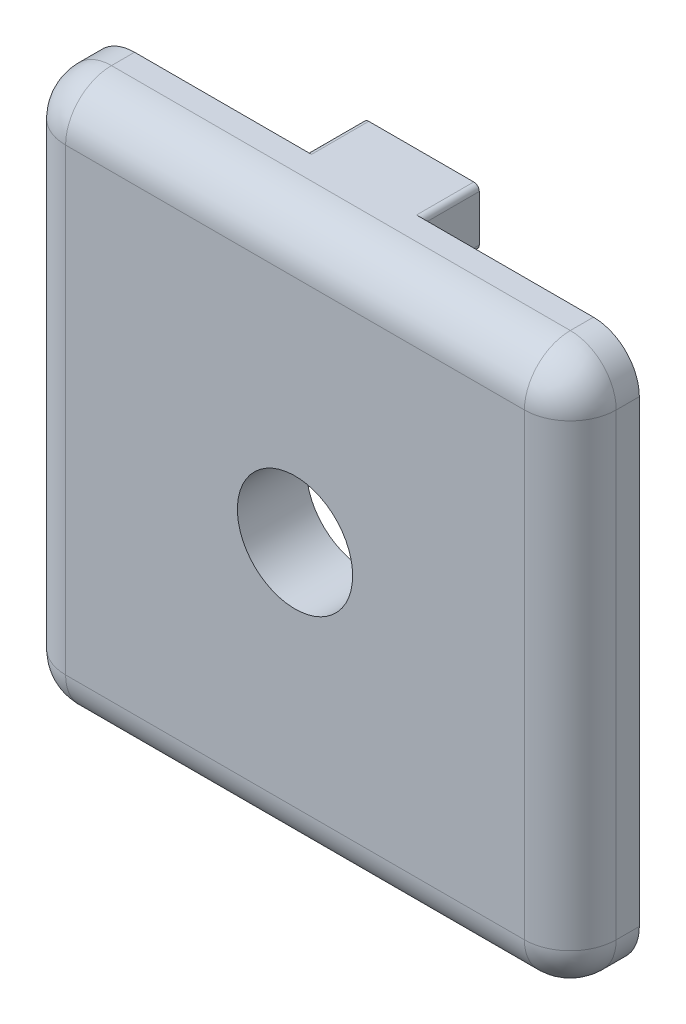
ISO-10303-21;
HEADER;
FILE_DESCRIPTION(('STEP AP214'),'2;1');
FILE_NAME('part.step','',(''),(''),'','','');
FILE_SCHEMA(('AUTOMOTIVE_DESIGN { 1 0 10303 214 1 1 1 1 }'));
ENDSEC;
DATA;
#1=APPLICATION_CONTEXT('core data for automotive mechanical design processes');
#2=APPLICATION_PROTOCOL_DEFINITION('international standard','automotive_design',2000,#1);
#3=PRODUCT_CONTEXT('',#1,'mechanical');
#4=PRODUCT('Part','Part','',(#3));
#5=PRODUCT_RELATED_PRODUCT_CATEGORY('part','',(#4));
#6=PRODUCT_DEFINITION_FORMATION('','',#4);
#7=PRODUCT_DEFINITION_CONTEXT('part definition',#1,'design');
#8=PRODUCT_DEFINITION('design','',#6,#7);
#9=PRODUCT_DEFINITION_SHAPE('','',#8);
#10=(LENGTH_UNIT() NAMED_UNIT(*) SI_UNIT(.MILLI.,.METRE.));
#11=(NAMED_UNIT(*) PLANE_ANGLE_UNIT() SI_UNIT($,.RADIAN.));
#12=(NAMED_UNIT(*) SI_UNIT($,.STERADIAN.) SOLID_ANGLE_UNIT());
#13=UNCERTAINTY_MEASURE_WITH_UNIT(LENGTH_MEASURE(1.E-05),#10,'distance_accuracy_value','');
#14=(GEOMETRIC_REPRESENTATION_CONTEXT(3) GLOBAL_UNCERTAINTY_ASSIGNED_CONTEXT((#13)) GLOBAL_UNIT_ASSIGNED_CONTEXT((#10,
#11,#12)) REPRESENTATION_CONTEXT('',''));
#15=CARTESIAN_POINT('',(0.,0.,0.));
#16=DIRECTION('',(0.,0.,1.));
#17=DIRECTION('',(1.,0.,0.));
#18=AXIS2_PLACEMENT_3D('',#15,#16,#17);
#19=CARTESIAN_POINT('',(-19.05,-19.05,0.));
#20=DIRECTION('',(0.,0.,1.));
#21=DIRECTION('',(1.,0.,0.));
#22=AXIS2_PLACEMENT_3D('',#19,#20,#21);
#23=PLANE('',#22);
#24=CARTESIAN_POINT('',(0.,0.,0.));
#25=DIRECTION('',(0.,0.,1.));
#26=DIRECTION('',(1.,0.,0.));
#27=AXIS2_PLACEMENT_3D('',#24,#25,#26);
#28=CIRCLE('',#27,3.9878);
#29=CARTESIAN_POINT('',(3.9878,0.,0.));
#30=VERTEX_POINT('',#29);
#31=EDGE_CURVE('E167',#30,#30,#28,.F.);
#32=ORIENTED_EDGE('',*,*,#31,.F.);
#33=EDGE_LOOP('',(#32));
#34=FACE_BOUND('',#33,.T.);
#35=DIRECTION('',(0.,-1.,0.));
#36=VECTOR('',#35,1.);
#37=CARTESIAN_POINT('',(4.0132,19.05,0.));
#38=LINE('',#37,#36);
#39=CARTESIAN_POINT('',(4.0132,18.669,0.));
#40=VERTEX_POINT('',#39);
#41=CARTESIAN_POINT('',(4.0132,15.4686,0.));
#42=VERTEX_POINT('',#41);
#43=EDGE_CURVE('E335',#40,#42,#38,.T.);
#44=ORIENTED_EDGE('',*,*,#43,.F.);
#45=CARTESIAN_POINT('',(3.6322,18.669,0.));
#46=DIRECTION('',(0.,0.,1.));
#47=DIRECTION('',(1.,0.,0.));
#48=AXIS2_PLACEMENT_3D('',#45,#46,#47);
#49=CIRCLE('',#48,0.381);
#50=CARTESIAN_POINT('',(3.6322,19.05,0.));
#51=VERTEX_POINT('',#50);
#52=EDGE_CURVE('E11',#40,#51,#49,.T.);
#53=ORIENTED_EDGE('',*,*,#52,.T.);
#54=DIRECTION('',(-1.,0.,0.));
#55=VECTOR('',#54,1.);
#56=CARTESIAN_POINT('',(-19.05,19.05,0.));
#57=LINE('',#56,#55);
#58=CARTESIAN_POINT('',(15.875,19.05,0.));
#59=VERTEX_POINT('',#58);
#60=EDGE_CURVE('E55',#59,#51,#57,.T.);
#61=ORIENTED_EDGE('',*,*,#60,.F.);
#62=CARTESIAN_POINT('',(15.875,15.875,0.));
#63=DIRECTION('',(0.,0.,1.));
#64=DIRECTION('',(1.,0.,0.));
#65=AXIS2_PLACEMENT_3D('',#62,#63,#64);
#66=CIRCLE('',#65,3.175);
#67=CARTESIAN_POINT('',(19.05,15.875,0.));
#68=VERTEX_POINT('',#67);
#69=EDGE_CURVE('E221',#59,#68,#66,.F.);
#70=ORIENTED_EDGE('',*,*,#69,.T.);
#71=DIRECTION('',(0.,1.,0.));
#72=VECTOR('',#71,1.);
#73=CARTESIAN_POINT('',(19.05,19.05,0.));
#74=LINE('',#73,#72);
#75=CARTESIAN_POINT('',(19.05,-15.875,0.));
#76=VERTEX_POINT('',#75);
#77=EDGE_CURVE('E257',#76,#68,#74,.T.);
#78=ORIENTED_EDGE('',*,*,#77,.F.);
#79=CARTESIAN_POINT('',(15.875,-15.875,0.));
#80=DIRECTION('',(0.,0.,1.));
#81=DIRECTION('',(1.,0.,0.));
#82=AXIS2_PLACEMENT_3D('',#79,#80,#81);
#83=CIRCLE('',#82,3.175);
#84=CARTESIAN_POINT('',(15.875,-19.05,0.));
#85=VERTEX_POINT('',#84);
#86=EDGE_CURVE('E223',#76,#85,#83,.F.);
#87=ORIENTED_EDGE('',*,*,#86,.T.);
#88=DIRECTION('',(1.,0.,0.));
#89=VECTOR('',#88,1.);
#90=CARTESIAN_POINT('',(-19.05,-19.05,0.));
#91=LINE('',#90,#89);
#92=CARTESIAN_POINT('',(-15.875,-19.05,0.));
#93=VERTEX_POINT('',#92);
#94=EDGE_CURVE('E297',#93,#85,#91,.T.);
#95=ORIENTED_EDGE('',*,*,#94,.F.);
#96=CARTESIAN_POINT('',(-15.875,-15.875,0.));
#97=DIRECTION('',(0.,0.,1.));
#98=DIRECTION('',(1.,0.,0.));
#99=AXIS2_PLACEMENT_3D('',#96,#97,#98);
#100=CIRCLE('',#99,3.175);
#101=CARTESIAN_POINT('',(-19.05,-15.875,0.));
#102=VERTEX_POINT('',#101);
#103=EDGE_CURVE('E225',#93,#102,#100,.F.);
#104=ORIENTED_EDGE('',*,*,#103,.T.);
#105=DIRECTION('',(0.,-1.,0.));
#106=VECTOR('',#105,1.);
#107=CARTESIAN_POINT('',(-19.05,19.05,0.));
#108=LINE('',#107,#106);
#109=CARTESIAN_POINT('',(-19.05,15.875,0.));
#110=VERTEX_POINT('',#109);
#111=EDGE_CURVE('E251',#110,#102,#108,.T.);
#112=ORIENTED_EDGE('',*,*,#111,.F.);
#113=CARTESIAN_POINT('',(-15.875,15.875,0.));
#114=DIRECTION('',(0.,0.,1.));
#115=DIRECTION('',(1.,0.,0.));
#116=AXIS2_PLACEMENT_3D('',#113,#114,#115);
#117=CIRCLE('',#116,3.175);
#118=CARTESIAN_POINT('',(-15.875,19.05,0.));
#119=VERTEX_POINT('',#118);
#120=EDGE_CURVE('E219',#110,#119,#117,.F.);
#121=ORIENTED_EDGE('',*,*,#120,.T.);
#122=CARTESIAN_POINT('',(-3.6322,19.05,0.));
#123=VERTEX_POINT('',#122);
#124=EDGE_CURVE('E47',#123,#119,#57,.T.);
#125=ORIENTED_EDGE('',*,*,#124,.F.);
#126=CARTESIAN_POINT('',(-3.6322,18.669,0.));
#127=DIRECTION('',(0.,0.,1.));
#128=DIRECTION('',(1.,0.,0.));
#129=AXIS2_PLACEMENT_3D('',#126,#127,#128);
#130=CIRCLE('',#129,0.381);
#131=CARTESIAN_POINT('',(-4.0132,18.669,0.));
#132=VERTEX_POINT('',#131);
#133=EDGE_CURVE('E40',#123,#132,#130,.T.);
#134=ORIENTED_EDGE('',*,*,#133,.T.);
#135=DIRECTION('',(0.,1.,0.));
#136=VECTOR('',#135,1.);
#137=CARTESIAN_POINT('',(-4.0132,19.05,0.));
#138=LINE('',#137,#136);
#139=CARTESIAN_POINT('',(-4.0132,15.4686,0.));
#140=VERTEX_POINT('',#139);
#141=EDGE_CURVE('E312',#140,#132,#138,.T.);
#142=ORIENTED_EDGE('',*,*,#141,.F.);
#143=CARTESIAN_POINT('',(-3.6322,15.4686,0.));
#144=DIRECTION('',(0.,0.,1.));
#145=DIRECTION('',(1.,0.,0.));
#146=AXIS2_PLACEMENT_3D('',#143,#144,#145);
#147=CIRCLE('',#146,0.381);
#148=CARTESIAN_POINT('',(-3.6322,15.0876,0.));
#149=VERTEX_POINT('',#148);
#150=EDGE_CURVE('E346',#140,#149,#147,.T.);
#151=ORIENTED_EDGE('',*,*,#150,.T.);
#152=DIRECTION('',(-1.,0.,0.));
#153=VECTOR('',#152,1.);
#154=CARTESIAN_POINT('',(4.0132,15.0876,0.));
#155=LINE('',#154,#153);
#156=CARTESIAN_POINT('',(3.6322,15.0876,0.));
#157=VERTEX_POINT('',#156);
#158=EDGE_CURVE('E309',#157,#149,#155,.T.);
#159=ORIENTED_EDGE('',*,*,#158,.F.);
#160=CARTESIAN_POINT('',(3.6322,15.4686,0.));
#161=DIRECTION('',(0.,0.,1.));
#162=DIRECTION('',(1.,0.,0.));
#163=AXIS2_PLACEMENT_3D('',#160,#161,#162);
#164=CIRCLE('',#163,0.381);
#165=EDGE_CURVE('E348',#157,#42,#164,.T.);
#166=ORIENTED_EDGE('',*,*,#165,.T.);
#167=EDGE_LOOP('',(#44,#53,#61,#70,#78,#87,#95,#104,#112,#121,#125,#134,#142,#151,#159,#166));
#168=FACE_BOUND('',#167,.T.);
#169=ADVANCED_FACE('F32',(#34,#168),#23,.F.);
#170=CARTESIAN_POINT('',(-19.05,19.05,4.7752));
#171=DIRECTION('',(1.,0.,0.));
#172=DIRECTION('',(0.,0.,-1.));
#173=AXIS2_PLACEMENT_3D('',#170,#171,#172);
#174=PLANE('',#173);
#175=ORIENTED_EDGE('',*,*,#111,.T.);
#176=DIRECTION('',(0.,0.,-1.));
#177=VECTOR('',#176,1.);
#178=CARTESIAN_POINT('',(-19.05,-15.875,4.7752));
#179=LINE('',#178,#177);
#180=CARTESIAN_POINT('',(-19.05,-15.875,1.6002));
#181=VERTEX_POINT('',#180);
#182=EDGE_CURVE('E217',#102,#181,#179,.F.);
#183=ORIENTED_EDGE('',*,*,#182,.T.);
#184=DIRECTION('',(0.,-1.,0.));
#185=VECTOR('',#184,1.);
#186=CARTESIAN_POINT('',(-19.05,19.05,1.6002));
#187=LINE('',#186,#185);
#188=CARTESIAN_POINT('',(-19.05,15.875,1.6002));
#189=VERTEX_POINT('',#188);
#190=EDGE_CURVE('E215',#181,#189,#187,.F.);
#191=ORIENTED_EDGE('',*,*,#190,.T.);
#192=DIRECTION('',(0.,0.,-1.));
#193=VECTOR('',#192,1.);
#194=CARTESIAN_POINT('',(-19.05,15.875,4.7752));
#195=LINE('',#194,#193);
#196=EDGE_CURVE('E213',#189,#110,#195,.T.);
#197=ORIENTED_EDGE('',*,*,#196,.T.);
#198=EDGE_LOOP('',(#175,#183,#191,#197));
#199=FACE_BOUND('',#198,.T.);
#200=ADVANCED_FACE('F292',(#199),#174,.F.);
#201=CARTESIAN_POINT('',(-19.05,-19.05,4.7752));
#202=DIRECTION('',(0.,1.,0.));
#203=DIRECTION('',(0.,0.,1.));
#204=AXIS2_PLACEMENT_3D('',#201,#202,#203);
#205=PLANE('',#204);
#206=DIRECTION('',(1.,0.,0.));
#207=VECTOR('',#206,1.);
#208=CARTESIAN_POINT('',(-19.05,-19.05,1.6002));
#209=LINE('',#208,#207);
#210=CARTESIAN_POINT('',(15.875,-19.05,1.6002));
#211=VERTEX_POINT('',#210);
#212=CARTESIAN_POINT('',(-15.875,-19.05,1.6002));
#213=VERTEX_POINT('',#212);
#214=EDGE_CURVE('E209',#211,#213,#209,.F.);
#215=ORIENTED_EDGE('',*,*,#214,.T.);
#216=DIRECTION('',(0.,0.,-1.));
#217=VECTOR('',#216,1.);
#218=CARTESIAN_POINT('',(-15.875,-19.05,4.7752));
#219=LINE('',#218,#217);
#220=EDGE_CURVE('E211',#213,#93,#219,.T.);
#221=ORIENTED_EDGE('',*,*,#220,.T.);
#222=ORIENTED_EDGE('',*,*,#94,.T.);
#223=DIRECTION('',(0.,0.,-1.));
#224=VECTOR('',#223,1.);
#225=CARTESIAN_POINT('',(15.875,-19.05,4.7752));
#226=LINE('',#225,#224);
#227=EDGE_CURVE('E207',#85,#211,#226,.F.);
#228=ORIENTED_EDGE('',*,*,#227,.T.);
#229=EDGE_LOOP('',(#215,#221,#222,#228));
#230=FACE_BOUND('',#229,.T.);
#231=ADVANCED_FACE('F404',(#230),#205,.F.);
#232=CARTESIAN_POINT('',(19.05,19.05,4.7752));
#233=DIRECTION('',(-1.,0.,0.));
#234=DIRECTION('',(0.,0.,1.));
#235=AXIS2_PLACEMENT_3D('',#232,#233,#234);
#236=PLANE('',#235);
#237=DIRECTION('',(0.,1.,0.));
#238=VECTOR('',#237,1.);
#239=CARTESIAN_POINT('',(19.05,-19.05,1.6002));
#240=LINE('',#239,#238);
#241=CARTESIAN_POINT('',(19.05,15.875,1.6002));
#242=VERTEX_POINT('',#241);
#243=CARTESIAN_POINT('',(19.05,-15.875,1.6002));
#244=VERTEX_POINT('',#243);
#245=EDGE_CURVE('E203',#242,#244,#240,.F.);
#246=ORIENTED_EDGE('',*,*,#245,.T.);
#247=DIRECTION('',(0.,0.,-1.));
#248=VECTOR('',#247,1.);
#249=CARTESIAN_POINT('',(19.05,-15.875,4.7752));
#250=LINE('',#249,#248);
#251=EDGE_CURVE('E205',#244,#76,#250,.T.);
#252=ORIENTED_EDGE('',*,*,#251,.T.);
#253=ORIENTED_EDGE('',*,*,#77,.T.);
#254=DIRECTION('',(0.,0.,-1.));
#255=VECTOR('',#254,1.);
#256=CARTESIAN_POINT('',(19.05,15.875,4.7752));
#257=LINE('',#256,#255);
#258=EDGE_CURVE('E201',#68,#242,#257,.F.);
#259=ORIENTED_EDGE('',*,*,#258,.T.);
#260=EDGE_LOOP('',(#246,#252,#253,#259));
#261=FACE_BOUND('',#260,.T.);
#262=ADVANCED_FACE('F412',(#261),#236,.F.);
#263=CARTESIAN_POINT('',(-19.05,19.05,4.7752));
#264=DIRECTION('',(0.,-1.,0.));
#265=DIRECTION('',(1.,0.,0.));
#266=AXIS2_PLACEMENT_3D('',#263,#264,#265);
#267=PLANE('',#266);
#268=DIRECTION('',(1.,0.,0.));
#269=VECTOR('',#268,1.);
#270=CARTESIAN_POINT('',(4.0132,19.05,-3.9624));
#271=LINE('',#270,#269);
#272=CARTESIAN_POINT('',(-3.6322,19.05,-3.9624));
#273=VERTEX_POINT('',#272);
#274=CARTESIAN_POINT('',(3.6322,19.05,-3.9624));
#275=VERTEX_POINT('',#274);
#276=EDGE_CURVE('E306',#273,#275,#271,.T.);
#277=ORIENTED_EDGE('',*,*,#276,.F.);
#278=DIRECTION('',(0.,0.,1.));
#279=VECTOR('',#278,1.);
#280=CARTESIAN_POINT('',(-3.6322,19.05,4.7752));
#281=LINE('',#280,#279);
#282=EDGE_CURVE('E344',#273,#123,#281,.T.);
#283=ORIENTED_EDGE('',*,*,#282,.T.);
#284=ORIENTED_EDGE('',*,*,#124,.T.);
#285=DIRECTION('',(0.,0.,-1.));
#286=VECTOR('',#285,1.);
#287=CARTESIAN_POINT('',(-15.875,19.05,4.7752));
#288=LINE('',#287,#286);
#289=CARTESIAN_POINT('',(-15.875,19.05,1.6002));
#290=VERTEX_POINT('',#289);
#291=EDGE_CURVE('E192',#119,#290,#288,.F.);
#292=ORIENTED_EDGE('',*,*,#291,.T.);
#293=DIRECTION('',(-1.,0.,0.));
#294=VECTOR('',#293,1.);
#295=CARTESIAN_POINT('',(19.05,19.05,1.6002));
#296=LINE('',#295,#294);
#297=CARTESIAN_POINT('',(15.875,19.05,1.6002));
#298=VERTEX_POINT('',#297);
#299=EDGE_CURVE('E163',#290,#298,#296,.F.);
#300=ORIENTED_EDGE('',*,*,#299,.T.);
#301=DIRECTION('',(0.,0.,-1.));
#302=VECTOR('',#301,1.);
#303=CARTESIAN_POINT('',(15.875,19.05,4.7752));
#304=LINE('',#303,#302);
#305=EDGE_CURVE('E199',#298,#59,#304,.T.);
#306=ORIENTED_EDGE('',*,*,#305,.T.);
#307=ORIENTED_EDGE('',*,*,#60,.T.);
#308=DIRECTION('',(0.,0.,1.));
#309=VECTOR('',#308,1.);
#310=CARTESIAN_POINT('',(3.6322,19.05,4.7752));
#311=LINE('',#310,#309);
#312=EDGE_CURVE('E342',#51,#275,#311,.F.);
#313=ORIENTED_EDGE('',*,*,#312,.T.);
#314=EDGE_LOOP('',(#277,#283,#284,#292,#300,#306,#307,#313));
#315=FACE_BOUND('',#314,.T.);
#316=ADVANCED_FACE('F282',(#315),#267,.F.);
#317=CARTESIAN_POINT('',(-19.05,-19.05,4.7752));
#318=DIRECTION('',(0.,0.,1.));
#319=DIRECTION('',(1.,0.,0.));
#320=AXIS2_PLACEMENT_3D('',#317,#318,#319);
#321=PLANE('',#320);
#322=CARTESIAN_POINT('',(0.,0.,4.7752));
#323=DIRECTION('',(0.,0.,1.));
#324=DIRECTION('',(1.,0.,0.));
#325=AXIS2_PLACEMENT_3D('',#322,#323,#324);
#326=CIRCLE('',#325,3.9878);
#327=CARTESIAN_POINT('',(3.9878,0.,4.7752));
#328=VERTEX_POINT('',#327);
#329=EDGE_CURVE('E303',#328,#328,#326,.T.);
#330=ORIENTED_EDGE('',*,*,#329,.F.);
#331=EDGE_LOOP('',(#330));
#332=FACE_BOUND('',#331,.T.);
#333=DIRECTION('',(0.,1.,0.));
#334=VECTOR('',#333,1.);
#335=CARTESIAN_POINT('',(15.875,19.05,4.7752));
#336=LINE('',#335,#334);
#337=CARTESIAN_POINT('',(15.875,-15.875,4.7752));
#338=VERTEX_POINT('',#337);
#339=CARTESIAN_POINT('',(15.875,15.875,4.7752));
#340=VERTEX_POINT('',#339);
#341=EDGE_CURVE('E190',#338,#340,#336,.T.);
#342=ORIENTED_EDGE('',*,*,#341,.T.);
#343=DIRECTION('',(-1.,0.,0.));
#344=VECTOR('',#343,1.);
#345=CARTESIAN_POINT('',(-19.05,15.875,4.7752));
#346=LINE('',#345,#344);
#347=CARTESIAN_POINT('',(-15.875,15.875,4.7752));
#348=VERTEX_POINT('',#347);
#349=EDGE_CURVE('E161',#340,#348,#346,.T.);
#350=ORIENTED_EDGE('',*,*,#349,.T.);
#351=DIRECTION('',(0.,-1.,0.));
#352=VECTOR('',#351,1.);
#353=CARTESIAN_POINT('',(-15.875,-19.05,4.7752));
#354=LINE('',#353,#352);
#355=CARTESIAN_POINT('',(-15.875,-15.875,4.7752));
#356=VERTEX_POINT('',#355);
#357=EDGE_CURVE('E180',#348,#356,#354,.T.);
#358=ORIENTED_EDGE('',*,*,#357,.T.);
#359=DIRECTION('',(1.,0.,0.));
#360=VECTOR('',#359,1.);
#361=CARTESIAN_POINT('',(19.05,-15.875,4.7752));
#362=LINE('',#361,#360);
#363=EDGE_CURVE('E186',#356,#338,#362,.T.);
#364=ORIENTED_EDGE('',*,*,#363,.T.);
#365=EDGE_LOOP('',(#342,#350,#358,#364));
#366=FACE_BOUND('',#365,.T.);
#367=ADVANCED_FACE('F188',(#332,#366),#321,.T.);
#368=CARTESIAN_POINT('',(15.875,-15.875,4.7752));
#369=DIRECTION('',(0.,0.,-1.));
#370=DIRECTION('',(-1.,0.,0.));
#371=AXIS2_PLACEMENT_3D('',#368,#369,#370);
#372=CYLINDRICAL_SURFACE('',#371,3.175);
#373=ORIENTED_EDGE('',*,*,#86,.F.);
#374=ORIENTED_EDGE('',*,*,#251,.F.);
#375=CARTESIAN_POINT('',(15.875,-15.875,1.6002));
#376=DIRECTION('',(0.,0.,1.));
#377=DIRECTION('',(1.,0.,0.));
#378=AXIS2_PLACEMENT_3D('',#375,#376,#377);
#379=CIRCLE('',#378,3.175);
#380=EDGE_CURVE('E248',#211,#244,#379,.T.);
#381=ORIENTED_EDGE('',*,*,#380,.F.);
#382=ORIENTED_EDGE('',*,*,#227,.F.);
#383=EDGE_LOOP('',(#373,#374,#381,#382));
#384=FACE_BOUND('',#383,.T.);
#385=ADVANCED_FACE('F445',(#384),#372,.T.);
#386=CARTESIAN_POINT('',(-19.05,-15.875,1.6002));
#387=DIRECTION('',(-1.,0.,0.));
#388=DIRECTION('',(0.,0.,1.));
#389=AXIS2_PLACEMENT_3D('',#386,#387,#388);
#390=CYLINDRICAL_SURFACE('',#389,3.175);
#391=CARTESIAN_POINT('',(-15.875,-15.875,1.6002));
#392=DIRECTION('',(-1.,0.,0.));
#393=DIRECTION('',(0.,0.,1.));
#394=AXIS2_PLACEMENT_3D('',#391,#392,#393);
#395=CIRCLE('',#394,3.175);
#396=EDGE_CURVE('E242',#213,#356,#395,.T.);
#397=ORIENTED_EDGE('',*,*,#396,.F.);
#398=ORIENTED_EDGE('',*,*,#214,.F.);
#399=CARTESIAN_POINT('',(15.875,-15.875,1.6002));
#400=DIRECTION('',(1.,0.,0.));
#401=DIRECTION('',(0.,1.,0.));
#402=AXIS2_PLACEMENT_3D('',#399,#400,#401);
#403=CIRCLE('',#402,3.175);
#404=EDGE_CURVE('E245',#338,#211,#403,.T.);
#405=ORIENTED_EDGE('',*,*,#404,.F.);
#406=ORIENTED_EDGE('',*,*,#363,.F.);
#407=EDGE_LOOP('',(#397,#398,#405,#406));
#408=FACE_BOUND('',#407,.T.);
#409=ADVANCED_FACE('F265',(#408),#390,.T.);
#410=CARTESIAN_POINT('',(-15.875,-15.875,4.7752));
#411=DIRECTION('',(0.,0.,-1.));
#412=DIRECTION('',(-1.,0.,0.));
#413=AXIS2_PLACEMENT_3D('',#410,#411,#412);
#414=CYLINDRICAL_SURFACE('',#413,3.175);
#415=ORIENTED_EDGE('',*,*,#103,.F.);
#416=ORIENTED_EDGE('',*,*,#220,.F.);
#417=CARTESIAN_POINT('',(-15.875,-15.875,1.6002));
#418=DIRECTION('',(0.,0.,1.));
#419=DIRECTION('',(1.,0.,0.));
#420=AXIS2_PLACEMENT_3D('',#417,#418,#419);
#421=CIRCLE('',#420,3.175);
#422=EDGE_CURVE('E239',#181,#213,#421,.T.);
#423=ORIENTED_EDGE('',*,*,#422,.F.);
#424=ORIENTED_EDGE('',*,*,#182,.F.);
#425=EDGE_LOOP('',(#415,#416,#423,#424));
#426=FACE_BOUND('',#425,.T.);
#427=ADVANCED_FACE('F440',(#426),#414,.T.);
#428=CARTESIAN_POINT('',(15.875,-15.875,1.6002));
#429=DIRECTION('',(0.,0.,1.));
#430=DIRECTION('',(1.,0.,0.));
#431=AXIS2_PLACEMENT_3D('',#428,#429,#430);
#432=SPHERICAL_SURFACE('',#431,3.175);
#433=ORIENTED_EDGE('',*,*,#404,.T.);
#434=ORIENTED_EDGE('',*,*,#380,.T.);
#435=CARTESIAN_POINT('',(15.875,-15.875,1.6002));
#436=DIRECTION('',(0.,-1.,0.));
#437=DIRECTION('',(0.,0.,-1.));
#438=AXIS2_PLACEMENT_3D('',#435,#436,#437);
#439=CIRCLE('',#438,3.175);
#440=EDGE_CURVE('E236',#338,#244,#439,.F.);
#441=ORIENTED_EDGE('',*,*,#440,.F.);
#442=EDGE_LOOP('',(#433,#434,#441));
#443=FACE_BOUND('',#442,.T.);
#444=ADVANCED_FACE('F268',(#443),#432,.T.);
#445=CARTESIAN_POINT('',(-15.875,-15.875,1.6002));
#446=DIRECTION('',(0.,0.,1.));
#447=DIRECTION('',(1.,0.,0.));
#448=AXIS2_PLACEMENT_3D('',#445,#446,#447);
#449=SPHERICAL_SURFACE('',#448,3.175);
#450=ORIENTED_EDGE('',*,*,#422,.T.);
#451=ORIENTED_EDGE('',*,*,#396,.T.);
#452=CARTESIAN_POINT('',(-15.875,-15.875,1.6002));
#453=DIRECTION('',(0.,-1.,0.));
#454=DIRECTION('',(0.,0.,-1.));
#455=AXIS2_PLACEMENT_3D('',#452,#453,#454);
#456=CIRCLE('',#455,3.175);
#457=EDGE_CURVE('E183',#181,#356,#456,.F.);
#458=ORIENTED_EDGE('',*,*,#457,.F.);
#459=EDGE_LOOP('',(#450,#451,#458));
#460=FACE_BOUND('',#459,.T.);
#461=ADVANCED_FACE('F434',(#460),#449,.T.);
#462=CARTESIAN_POINT('',(15.875,15.875,4.7752));
#463=DIRECTION('',(0.,0.,-1.));
#464=DIRECTION('',(-1.,0.,0.));
#465=AXIS2_PLACEMENT_3D('',#462,#463,#464);
#466=CYLINDRICAL_SURFACE('',#465,3.175);
#467=ORIENTED_EDGE('',*,*,#69,.F.);
#468=ORIENTED_EDGE('',*,*,#305,.F.);
#469=CARTESIAN_POINT('',(15.875,15.875,1.6002));
#470=DIRECTION('',(0.,0.,1.));
#471=DIRECTION('',(1.,0.,0.));
#472=AXIS2_PLACEMENT_3D('',#469,#470,#471);
#473=CIRCLE('',#472,3.175);
#474=EDGE_CURVE('E232',#242,#298,#473,.T.);
#475=ORIENTED_EDGE('',*,*,#474,.F.);
#476=ORIENTED_EDGE('',*,*,#258,.F.);
#477=EDGE_LOOP('',(#467,#468,#475,#476));
#478=FACE_BOUND('',#477,.T.);
#479=ADVANCED_FACE('F280',(#478),#466,.T.);
#480=CARTESIAN_POINT('',(15.875,-19.05,1.6002));
#481=DIRECTION('',(0.,-1.,0.));
#482=DIRECTION('',(0.,0.,-1.));
#483=AXIS2_PLACEMENT_3D('',#480,#481,#482);
#484=CYLINDRICAL_SURFACE('',#483,3.175);
#485=ORIENTED_EDGE('',*,*,#440,.T.);
#486=ORIENTED_EDGE('',*,*,#245,.F.);
#487=CARTESIAN_POINT('',(15.875,15.875,1.6002));
#488=DIRECTION('',(0.,1.,0.));
#489=DIRECTION('',(-1.,0.,0.));
#490=AXIS2_PLACEMENT_3D('',#487,#488,#489);
#491=CIRCLE('',#490,3.175);
#492=EDGE_CURVE('E177',#340,#242,#491,.T.);
#493=ORIENTED_EDGE('',*,*,#492,.F.);
#494=ORIENTED_EDGE('',*,*,#341,.F.);
#495=EDGE_LOOP('',(#485,#486,#493,#494));
#496=FACE_BOUND('',#495,.T.);
#497=ADVANCED_FACE('F271',(#496),#484,.T.);
#498=CARTESIAN_POINT('',(-15.875,-19.05,1.6002));
#499=DIRECTION('',(0.,1.,0.));
#500=DIRECTION('',(0.,0.,1.));
#501=AXIS2_PLACEMENT_3D('',#498,#499,#500);
#502=CYLINDRICAL_SURFACE('',#501,3.175);
#503=ORIENTED_EDGE('',*,*,#457,.T.);
#504=ORIENTED_EDGE('',*,*,#357,.F.);
#505=CARTESIAN_POINT('',(-15.875,15.875,1.6002));
#506=DIRECTION('',(0.,1.,0.));
#507=DIRECTION('',(0.,0.,1.));
#508=AXIS2_PLACEMENT_3D('',#505,#506,#507);
#509=CIRCLE('',#508,3.175);
#510=EDGE_CURVE('E170',#189,#348,#509,.T.);
#511=ORIENTED_EDGE('',*,*,#510,.F.);
#512=ORIENTED_EDGE('',*,*,#190,.F.);
#513=EDGE_LOOP('',(#503,#504,#511,#512));
#514=FACE_BOUND('',#513,.T.);
#515=ADVANCED_FACE('F181',(#514),#502,.T.);
#516=CARTESIAN_POINT('',(-15.875,15.875,4.7752));
#517=DIRECTION('',(0.,0.,-1.));
#518=DIRECTION('',(-1.,0.,0.));
#519=AXIS2_PLACEMENT_3D('',#516,#517,#518);
#520=CYLINDRICAL_SURFACE('',#519,3.175);
#521=ORIENTED_EDGE('',*,*,#120,.F.);
#522=ORIENTED_EDGE('',*,*,#196,.F.);
#523=CARTESIAN_POINT('',(-15.875,15.875,1.6002));
#524=DIRECTION('',(0.,0.,1.));
#525=DIRECTION('',(1.,0.,0.));
#526=AXIS2_PLACEMENT_3D('',#523,#524,#525);
#527=CIRCLE('',#526,3.175);
#528=EDGE_CURVE('E174',#290,#189,#527,.T.);
#529=ORIENTED_EDGE('',*,*,#528,.F.);
#530=ORIENTED_EDGE('',*,*,#291,.F.);
#531=EDGE_LOOP('',(#521,#522,#529,#530));
#532=FACE_BOUND('',#531,.T.);
#533=ADVANCED_FACE('F288',(#532),#520,.T.);
#534=CARTESIAN_POINT('',(15.875,15.875,1.6002));
#535=DIRECTION('',(0.,0.,1.));
#536=DIRECTION('',(1.,0.,0.));
#537=AXIS2_PLACEMENT_3D('',#534,#535,#536);
#538=SPHERICAL_SURFACE('',#537,3.175);
#539=ORIENTED_EDGE('',*,*,#492,.T.);
#540=ORIENTED_EDGE('',*,*,#474,.T.);
#541=CARTESIAN_POINT('',(15.875,15.875,1.6002));
#542=DIRECTION('',(1.,0.,0.));
#543=DIRECTION('',(0.,0.,-1.));
#544=AXIS2_PLACEMENT_3D('',#541,#542,#543);
#545=CIRCLE('',#544,3.175);
#546=EDGE_CURVE('E166',#340,#298,#545,.F.);
#547=ORIENTED_EDGE('',*,*,#546,.F.);
#548=EDGE_LOOP('',(#539,#540,#547));
#549=FACE_BOUND('',#548,.T.);
#550=ADVANCED_FACE('F275',(#549),#538,.T.);
#551=CARTESIAN_POINT('',(-15.875,15.875,1.6002));
#552=DIRECTION('',(0.,0.,1.));
#553=DIRECTION('',(1.,0.,0.));
#554=AXIS2_PLACEMENT_3D('',#551,#552,#553);
#555=SPHERICAL_SURFACE('',#554,3.175);
#556=ORIENTED_EDGE('',*,*,#528,.T.);
#557=ORIENTED_EDGE('',*,*,#510,.T.);
#558=CARTESIAN_POINT('',(-15.875,15.875,1.6002));
#559=DIRECTION('',(-1.,0.,0.));
#560=DIRECTION('',(0.,0.,1.));
#561=AXIS2_PLACEMENT_3D('',#558,#559,#560);
#562=CIRCLE('',#561,3.175);
#563=EDGE_CURVE('E157',#290,#348,#562,.F.);
#564=ORIENTED_EDGE('',*,*,#563,.F.);
#565=EDGE_LOOP('',(#556,#557,#564));
#566=FACE_BOUND('',#565,.T.);
#567=ADVANCED_FACE('F172',(#566),#555,.T.);
#568=CARTESIAN_POINT('',(-19.05,15.875,1.6002));
#569=DIRECTION('',(1.,0.,0.));
#570=DIRECTION('',(0.,1.,0.));
#571=AXIS2_PLACEMENT_3D('',#568,#569,#570);
#572=CYLINDRICAL_SURFACE('',#571,3.175);
#573=ORIENTED_EDGE('',*,*,#546,.T.);
#574=ORIENTED_EDGE('',*,*,#299,.F.);
#575=ORIENTED_EDGE('',*,*,#563,.T.);
#576=ORIENTED_EDGE('',*,*,#349,.F.);
#577=EDGE_LOOP('',(#573,#574,#575,#576));
#578=FACE_BOUND('',#577,.T.);
#579=ADVANCED_FACE('F159',(#578),#572,.T.);
#580=CARTESIAN_POINT('',(0.,0.,-0.00100000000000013));
#581=DIRECTION('',(0.,0.,1.));
#582=DIRECTION('',(1.,0.,0.));
#583=AXIS2_PLACEMENT_3D('',#580,#581,#582);
#584=CYLINDRICAL_SURFACE('',#583,3.9878);
#585=CARTESIAN_POINT('',(3.9878,0.,4.7752));
#586=CARTESIAN_POINT('',(3.9878,0.,4.72545833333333));
#587=CARTESIAN_POINT('',(3.9878,0.,4.67571666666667));
#588=CARTESIAN_POINT('',(3.9878,0.,4.57623333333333));
#589=CARTESIAN_POINT('',(3.9878,0.,4.52649166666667));
#590=CARTESIAN_POINT('',(3.9878,0.,4.42700833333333));
#591=CARTESIAN_POINT('',(3.9878,0.,4.37726666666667));
#592=CARTESIAN_POINT('',(3.9878,0.,4.27778333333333));
#593=CARTESIAN_POINT('',(3.9878,0.,4.22804166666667));
#594=CARTESIAN_POINT('',(3.9878,0.,4.12855833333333));
#595=CARTESIAN_POINT('',(3.9878,0.,4.07881666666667));
#596=CARTESIAN_POINT('',(3.9878,0.,3.97933333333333));
#597=CARTESIAN_POINT('',(3.9878,0.,3.92959166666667));
#598=CARTESIAN_POINT('',(3.9878,0.,3.83010833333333));
#599=CARTESIAN_POINT('',(3.9878,0.,3.78036666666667));
#600=CARTESIAN_POINT('',(3.9878,0.,3.68088333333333));
#601=CARTESIAN_POINT('',(3.9878,0.,3.63114166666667));
#602=CARTESIAN_POINT('',(3.9878,0.,3.53165833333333));
#603=CARTESIAN_POINT('',(3.9878,0.,3.48191666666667));
#604=CARTESIAN_POINT('',(3.9878,0.,3.38243333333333));
#605=CARTESIAN_POINT('',(3.9878,0.,3.33269166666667));
#606=CARTESIAN_POINT('',(3.9878,0.,3.23320833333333));
#607=CARTESIAN_POINT('',(3.9878,0.,3.18346666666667));
#608=CARTESIAN_POINT('',(3.9878,0.,3.08398333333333));
#609=CARTESIAN_POINT('',(3.9878,0.,3.03424166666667));
#610=CARTESIAN_POINT('',(3.9878,0.,2.93475833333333));
#611=CARTESIAN_POINT('',(3.9878,0.,2.88501666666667));
#612=CARTESIAN_POINT('',(3.9878,0.,2.78553333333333));
#613=CARTESIAN_POINT('',(3.9878,0.,2.73579166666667));
#614=CARTESIAN_POINT('',(3.9878,0.,2.63630833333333));
#615=CARTESIAN_POINT('',(3.9878,0.,2.58656666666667));
#616=CARTESIAN_POINT('',(3.9878,0.,2.48708333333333));
#617=CARTESIAN_POINT('',(3.9878,0.,2.43734166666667));
#618=CARTESIAN_POINT('',(3.9878,0.,2.33785833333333));
#619=CARTESIAN_POINT('',(3.9878,0.,2.28811666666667));
#620=CARTESIAN_POINT('',(3.9878,0.,2.18863333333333));
#621=CARTESIAN_POINT('',(3.9878,0.,2.13889166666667));
#622=CARTESIAN_POINT('',(3.9878,0.,2.03940833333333));
#623=CARTESIAN_POINT('',(3.9878,0.,1.98966666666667));
#624=CARTESIAN_POINT('',(3.9878,0.,1.89018333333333));
#625=CARTESIAN_POINT('',(3.9878,0.,1.84044166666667));
#626=CARTESIAN_POINT('',(3.9878,0.,1.74095833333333));
#627=CARTESIAN_POINT('',(3.9878,0.,1.69121666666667));
#628=CARTESIAN_POINT('',(3.9878,0.,1.59173333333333));
#629=CARTESIAN_POINT('',(3.9878,0.,1.54199166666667));
#630=CARTESIAN_POINT('',(3.9878,0.,1.44250833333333));
#631=CARTESIAN_POINT('',(3.9878,0.,1.39276666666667));
#632=CARTESIAN_POINT('',(3.9878,0.,1.29328333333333));
#633=CARTESIAN_POINT('',(3.9878,0.,1.24354166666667));
#634=CARTESIAN_POINT('',(3.9878,0.,1.14405833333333));
#635=CARTESIAN_POINT('',(3.9878,0.,1.09431666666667));
#636=CARTESIAN_POINT('',(3.9878,0.,0.994833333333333));
#637=CARTESIAN_POINT('',(3.9878,0.,0.945091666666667));
#638=CARTESIAN_POINT('',(3.9878,0.,0.845608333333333));
#639=CARTESIAN_POINT('',(3.9878,0.,0.795866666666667));
#640=CARTESIAN_POINT('',(3.9878,0.,0.696383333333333));
#641=CARTESIAN_POINT('',(3.9878,0.,0.646641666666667));
#642=CARTESIAN_POINT('',(3.9878,0.,0.547158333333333));
#643=CARTESIAN_POINT('',(3.9878,0.,0.497416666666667));
#644=CARTESIAN_POINT('',(3.9878,0.,0.397933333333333));
#645=CARTESIAN_POINT('',(3.9878,0.,0.348191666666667));
#646=CARTESIAN_POINT('',(3.9878,0.,0.248708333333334));
#647=CARTESIAN_POINT('',(3.9878,0.,0.198966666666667));
#648=CARTESIAN_POINT('',(3.9878,0.,0.0994833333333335));
#649=CARTESIAN_POINT('',(3.9878,0.,0.0497416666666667));
#650=CARTESIAN_POINT('',(3.9878,0.,0.));
#651=B_SPLINE_CURVE_WITH_KNOTS('',3,(#585,#586,#587,#588,#589,#590,#591,#592,#593,#594,#595,
#596,#597,#598,#599,#600,#601,#602,#603,#604,#605,#606,#607,#608,#609,#610,#611,#612,#613,#614,
#615,#616,#617,#618,#619,#620,#621,#622,#623,#624,#625,#626,#627,#628,#629,#630,#631,#632,#633,
#634,#635,#636,#637,#638,#639,#640,#641,#642,#643,#644,#645,#646,#647,#648,#649,#650),
.UNSPECIFIED.,.F.,.F.,(4,2,2,2,2,2,2,2,2,2,2,2,2,2,2,2,2,2,2,2,2,2,2,2,2,2,2,2,2,2,2,2,4),(0.,
0.149225,0.29845,0.447675,0.5969,0.746125,0.89535,1.044575,1.1938,1.343025,1.49225,1.641475,
1.7907,1.939925,2.08915,2.238375,2.3876,2.536825,2.68605,2.835275,2.9845,3.133725,3.28295,
3.432175,3.5814,3.730625,3.87985,4.029075,4.1783,4.327525,4.47675,4.625975,4.7752),.UNSPECIFIED.);
#652=EDGE_CURVE('BSEAM421',#328,#30,#651,.T.);
#653=ORIENTED_EDGE('',*,*,#329,.T.);
#654=ORIENTED_EDGE('',*,*,#31,.T.);
#655=ORIENTED_EDGE('',*,*,#652,.T.);
#656=ORIENTED_EDGE('',*,*,#652,.F.);
#657=EDGE_LOOP('',(#653,#655,#654,#656));
#658=FACE_BOUND('',#657,.T.);
#659=ADVANCED_FACE('F421',(#658),#584,.F.);
#660=CARTESIAN_POINT('',(4.0132,19.05,-3.9624));
#661=DIRECTION('',(-1.,0.,0.));
#662=DIRECTION('',(0.,-1.,0.));
#663=AXIS2_PLACEMENT_3D('',#660,#661,#662);
#664=PLANE('',#663);
#665=ORIENTED_EDGE('',*,*,#43,.T.);
#666=DIRECTION('',(0.,0.,1.));
#667=VECTOR('',#666,1.);
#668=CARTESIAN_POINT('',(4.0132,15.4686,-3.9624));
#669=LINE('',#668,#667);
#670=CARTESIAN_POINT('',(4.0132,15.4686,-3.9624));
#671=VERTEX_POINT('',#670);
#672=EDGE_CURVE('E340',#42,#671,#669,.F.);
#673=ORIENTED_EDGE('',*,*,#672,.T.);
#674=DIRECTION('',(0.,-1.,0.));
#675=VECTOR('',#674,1.);
#676=CARTESIAN_POINT('',(4.0132,19.05,-3.9624));
#677=LINE('',#676,#675);
#678=CARTESIAN_POINT('',(4.0132,18.669,-3.9624));
#679=VERTEX_POINT('',#678);
#680=EDGE_CURVE('E315',#679,#671,#677,.T.);
#681=ORIENTED_EDGE('',*,*,#680,.F.);
#682=DIRECTION('',(0.,0.,1.));
#683=VECTOR('',#682,1.);
#684=CARTESIAN_POINT('',(4.0132,18.669,-3.9624));
#685=LINE('',#684,#683);
#686=EDGE_CURVE('E334',#679,#40,#685,.T.);
#687=ORIENTED_EDGE('',*,*,#686,.T.);
#688=EDGE_LOOP('',(#665,#673,#681,#687));
#689=FACE_BOUND('',#688,.T.);
#690=ADVANCED_FACE('F460',(#689),#664,.F.);
#691=CARTESIAN_POINT('',(4.0132,15.0876,-3.9624));
#692=DIRECTION('',(0.,1.,0.));
#693=DIRECTION('',(0.,0.,1.));
#694=AXIS2_PLACEMENT_3D('',#691,#692,#693);
#695=PLANE('',#694);
#696=ORIENTED_EDGE('',*,*,#158,.T.);
#697=DIRECTION('',(0.,0.,1.));
#698=VECTOR('',#697,1.);
#699=CARTESIAN_POINT('',(-3.6322,15.0876,-3.9624));
#700=LINE('',#699,#698);
#701=CARTESIAN_POINT('',(-3.6322,15.0876,-3.9624));
#702=VERTEX_POINT('',#701);
#703=EDGE_CURVE('E324',#149,#702,#700,.F.);
#704=ORIENTED_EDGE('',*,*,#703,.T.);
#705=DIRECTION('',(-1.,0.,0.));
#706=VECTOR('',#705,1.);
#707=CARTESIAN_POINT('',(4.0132,15.0876,-3.9624));
#708=LINE('',#707,#706);
#709=CARTESIAN_POINT('',(3.6322,15.0876,-3.9624));
#710=VERTEX_POINT('',#709);
#711=EDGE_CURVE('E367',#710,#702,#708,.T.);
#712=ORIENTED_EDGE('',*,*,#711,.F.);
#713=DIRECTION('',(0.,0.,1.));
#714=VECTOR('',#713,1.);
#715=CARTESIAN_POINT('',(3.6322,15.0876,-3.9624));
#716=LINE('',#715,#714);
#717=EDGE_CURVE('E321',#710,#157,#716,.T.);
#718=ORIENTED_EDGE('',*,*,#717,.T.);
#719=EDGE_LOOP('',(#696,#704,#712,#718));
#720=FACE_BOUND('',#719,.T.);
#721=ADVANCED_FACE('F384',(#720),#695,.F.);
#722=CARTESIAN_POINT('',(-4.0132,19.05,-3.9624));
#723=DIRECTION('',(1.,0.,0.));
#724=DIRECTION('',(0.,1.,0.));
#725=AXIS2_PLACEMENT_3D('',#722,#723,#724);
#726=PLANE('',#725);
#727=DIRECTION('',(0.,1.,0.));
#728=VECTOR('',#727,1.);
#729=CARTESIAN_POINT('',(-4.0132,19.05,-3.9624));
#730=LINE('',#729,#728);
#731=CARTESIAN_POINT('',(-4.0132,15.4686,-3.9624));
#732=VERTEX_POINT('',#731);
#733=CARTESIAN_POINT('',(-4.0132,18.669,-3.9624));
#734=VERTEX_POINT('',#733);
#735=EDGE_CURVE('E365',#732,#734,#730,.T.);
#736=ORIENTED_EDGE('',*,*,#735,.F.);
#737=DIRECTION('',(0.,0.,1.));
#738=VECTOR('',#737,1.);
#739=CARTESIAN_POINT('',(-4.0132,15.4686,-3.9624));
#740=LINE('',#739,#738);
#741=EDGE_CURVE('E318',#732,#140,#740,.T.);
#742=ORIENTED_EDGE('',*,*,#741,.T.);
#743=ORIENTED_EDGE('',*,*,#141,.T.);
#744=DIRECTION('',(0.,0.,1.));
#745=VECTOR('',#744,1.);
#746=CARTESIAN_POINT('',(-4.0132,18.669,-3.9624));
#747=LINE('',#746,#745);
#748=EDGE_CURVE('E226',#132,#734,#747,.F.);
#749=ORIENTED_EDGE('',*,*,#748,.T.);
#750=EDGE_LOOP('',(#736,#742,#743,#749));
#751=FACE_BOUND('',#750,.T.);
#752=ADVANCED_FACE('F355',(#751),#726,.F.);
#753=CARTESIAN_POINT('',(4.0132,15.0876,-3.9624));
#754=DIRECTION('',(0.,0.,-1.));
#755=DIRECTION('',(-1.,0.,0.));
#756=AXIS2_PLACEMENT_3D('',#753,#754,#755);
#757=PLANE('',#756);
#758=ORIENTED_EDGE('',*,*,#711,.T.);
#759=CARTESIAN_POINT('',(-3.6322,15.4686,-3.9624));
#760=DIRECTION('',(0.,0.,-1.));
#761=DIRECTION('',(-1.,0.,0.));
#762=AXIS2_PLACEMENT_3D('',#759,#760,#761);
#763=CIRCLE('',#762,0.381);
#764=EDGE_CURVE('E332',#702,#732,#763,.T.);
#765=ORIENTED_EDGE('',*,*,#764,.T.);
#766=ORIENTED_EDGE('',*,*,#735,.T.);
#767=CARTESIAN_POINT('',(-3.6322,18.669,-3.9624));
#768=DIRECTION('',(0.,0.,-1.));
#769=DIRECTION('',(-1.,0.,0.));
#770=AXIS2_PLACEMENT_3D('',#767,#768,#769);
#771=CIRCLE('',#770,0.381);
#772=EDGE_CURVE('E328',#734,#273,#771,.T.);
#773=ORIENTED_EDGE('',*,*,#772,.T.);
#774=ORIENTED_EDGE('',*,*,#276,.T.);
#775=CARTESIAN_POINT('',(3.6322,18.669,-3.9624));
#776=DIRECTION('',(0.,0.,-1.));
#777=DIRECTION('',(-1.,0.,0.));
#778=AXIS2_PLACEMENT_3D('',#775,#776,#777);
#779=CIRCLE('',#778,0.381);
#780=EDGE_CURVE('E326',#275,#679,#779,.T.);
#781=ORIENTED_EDGE('',*,*,#780,.T.);
#782=ORIENTED_EDGE('',*,*,#680,.T.);
#783=CARTESIAN_POINT('',(3.6322,15.4686,-3.9624));
#784=DIRECTION('',(0.,0.,-1.));
#785=DIRECTION('',(-1.,0.,0.));
#786=AXIS2_PLACEMENT_3D('',#783,#784,#785);
#787=CIRCLE('',#786,0.381);
#788=EDGE_CURVE('E330',#671,#710,#787,.T.);
#789=ORIENTED_EDGE('',*,*,#788,.T.);
#790=EDGE_LOOP('',(#758,#765,#766,#773,#774,#781,#782,#789));
#791=FACE_BOUND('',#790,.T.);
#792=ADVANCED_FACE('F363',(#791),#757,.T.);
#793=CARTESIAN_POINT('',(-3.6322,15.4686,-3.9624));
#794=DIRECTION('',(0.,0.,1.));
#795=DIRECTION('',(1.,0.,0.));
#796=AXIS2_PLACEMENT_3D('',#793,#794,#795);
#797=CYLINDRICAL_SURFACE('',#796,0.381);
#798=ORIENTED_EDGE('',*,*,#764,.F.);
#799=ORIENTED_EDGE('',*,*,#703,.F.);
#800=ORIENTED_EDGE('',*,*,#150,.F.);
#801=ORIENTED_EDGE('',*,*,#741,.F.);
#802=EDGE_LOOP('',(#798,#799,#800,#801));
#803=FACE_BOUND('',#802,.T.);
#804=ADVANCED_FACE('F388',(#803),#797,.T.);
#805=CARTESIAN_POINT('',(3.6322,15.4686,-3.9624));
#806=DIRECTION('',(0.,0.,1.));
#807=DIRECTION('',(1.,0.,0.));
#808=AXIS2_PLACEMENT_3D('',#805,#806,#807);
#809=CYLINDRICAL_SURFACE('',#808,0.381);
#810=ORIENTED_EDGE('',*,*,#788,.F.);
#811=ORIENTED_EDGE('',*,*,#672,.F.);
#812=ORIENTED_EDGE('',*,*,#165,.F.);
#813=ORIENTED_EDGE('',*,*,#717,.F.);
#814=EDGE_LOOP('',(#810,#811,#812,#813));
#815=FACE_BOUND('',#814,.T.);
#816=ADVANCED_FACE('F380',(#815),#809,.T.);
#817=CARTESIAN_POINT('',(-3.6322,18.669,4.7752));
#818=DIRECTION('',(0.,0.,1.));
#819=DIRECTION('',(1.,0.,0.));
#820=AXIS2_PLACEMENT_3D('',#817,#818,#819);
#821=CYLINDRICAL_SURFACE('',#820,0.381);
#822=ORIENTED_EDGE('',*,*,#772,.F.);
#823=ORIENTED_EDGE('',*,*,#748,.F.);
#824=ORIENTED_EDGE('',*,*,#133,.F.);
#825=ORIENTED_EDGE('',*,*,#282,.F.);
#826=EDGE_LOOP('',(#822,#823,#824,#825));
#827=FACE_BOUND('',#826,.T.);
#828=ADVANCED_FACE('F359',(#827),#821,.T.);
#829=CARTESIAN_POINT('',(3.6322,18.669,-3.9624));
#830=DIRECTION('',(0.,0.,1.));
#831=DIRECTION('',(1.,0.,0.));
#832=AXIS2_PLACEMENT_3D('',#829,#830,#831);
#833=CYLINDRICAL_SURFACE('',#832,0.381);
#834=ORIENTED_EDGE('',*,*,#780,.F.);
#835=ORIENTED_EDGE('',*,*,#312,.F.);
#836=ORIENTED_EDGE('',*,*,#52,.F.);
#837=ORIENTED_EDGE('',*,*,#686,.F.);
#838=EDGE_LOOP('',(#834,#835,#836,#837));
#839=FACE_BOUND('',#838,.T.);
#840=ADVANCED_FACE('F34',(#839),#833,.T.);
#841=CLOSED_SHELL('',(#169,#200,#231,#262,#316,#367,#385,#409,#427,#444,#461,#479,#497,#515,
#533,#550,#567,#579,#659,#690,#721,#752,#792,#804,#816,#828,#840));
#842=MANIFOLD_SOLID_BREP('B2',#841);
#843=ADVANCED_BREP_SHAPE_REPRESENTATION('',(#18,#842),#14);
#844=SHAPE_DEFINITION_REPRESENTATION(#9,#843);
ENDSEC;
END-ISO-10303-21;
